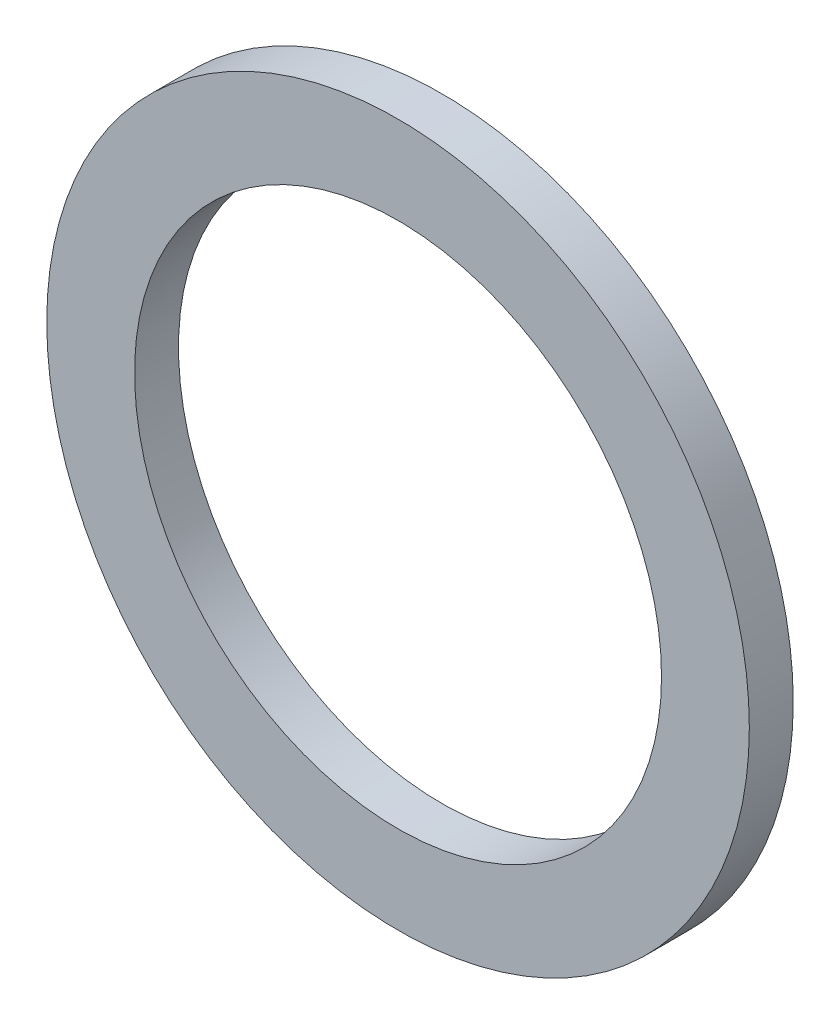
from build123d import *

# Parameters (mm, degrees)
ESQUISSE1_R        = 8
ESQUISSE1_R_2      = 6
BOSS_EXTRU_1_DEPTH = 1


with BuildPart() as part:
    # Esquisse1 → Boss.-Extru.1 (new body)
    with BuildSketch(Plane.XY):
        Circle(ESQUISSE1_R)
        Circle(ESQUISSE1_R_2, mode=Mode.SUBTRACT)
    extrude(amount=-BOSS_EXTRU_1_DEPTH)


solid = part.part
